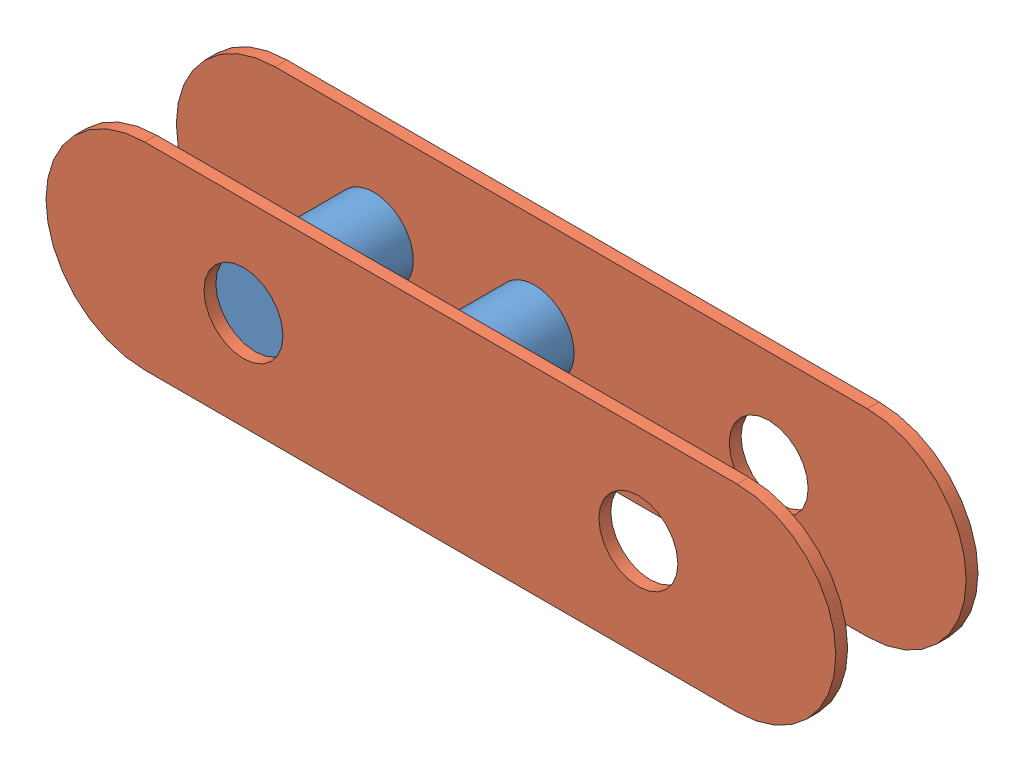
SolidWorks assembly Montagem3.sldasm, configuration Valor predeterminado (file format 4700). Lengths in mm.
Overall size (20 5 3.6).
3 component instances, 2 part files, 4 mates.
Components (placement in the parent):
- Peça3-1: Peça3.SLDPRT [Valor predeterminado] at (3.3697 -6.4198 -1.5) size (6.07 2 3)
- Peça2-1: Peça2.SLDPRT [Valor predeterminado] at (28.7959 -6.4198 -1.8) size (20 5 0.3)
- Peça2-2: Peça2.SLDPRT [Valor predeterminado] at (28.7959 -6.4198 1.5) size (20 5 0.3)
Mates (geometry in assembly coordinates):
- Coincidente1: coincident anti-aligned: cylinder of Peça3-1 through (-3.4925 1.2371 1.5) axis (0 0 -1) radius 1; circle of Peça2-2
- Concêntrico2: concentric aligned: cylinder of Peça2-1 through (-5.9925 1.2371 -1.5) axis (0 0 -1) radius 2.5; cylinder of Peça2-2 through (-5.9925 1.2371 1.8) axis (0 0 -1) radius 2.5
- Coincidente9: coincident anti-aligned: plane of Peça3-1 through (-3.4925 1.2371 -1.5) normal (0 0 -1); circle of Peça2-1
- Coincidente11: coincident aligned: plane of Peça3-1 through (-3.4925 1.2371 1.5) normal (0 0 1); circle of Peça2-2
